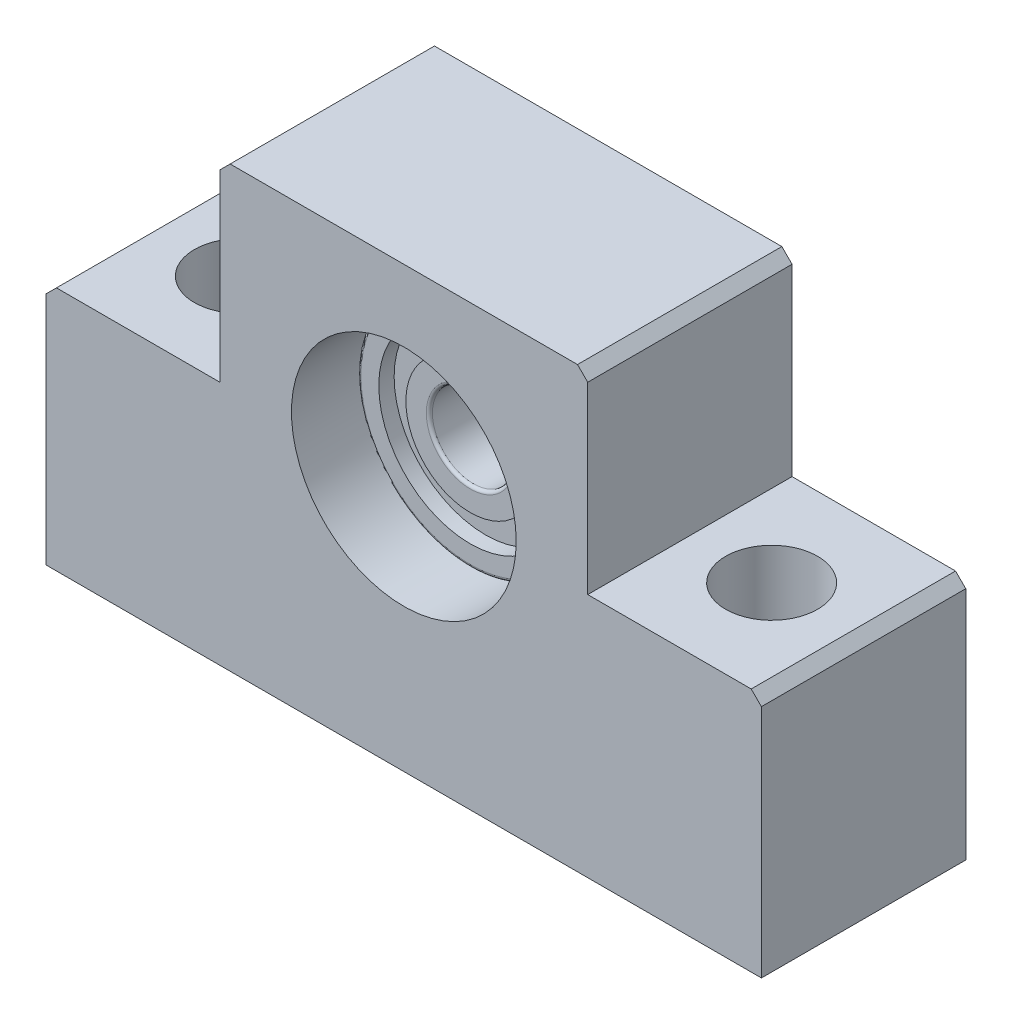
ISO-10303-21;
HEADER;
FILE_DESCRIPTION(('STEP AP214'),'2;1');
FILE_NAME('part.step','',(''),(''),'','','');
FILE_SCHEMA(('AUTOMOTIVE_DESIGN { 1 0 10303 214 1 1 1 1 }'));
ENDSEC;
DATA;
#1=APPLICATION_CONTEXT('core data for automotive mechanical design processes');
#2=APPLICATION_PROTOCOL_DEFINITION('international standard','automotive_design',2000,#1);
#3=PRODUCT_CONTEXT('',#1,'mechanical');
#4=PRODUCT('Part','Part','',(#3));
#5=PRODUCT_RELATED_PRODUCT_CATEGORY('part','',(#4));
#6=PRODUCT_DEFINITION_FORMATION('','',#4);
#7=PRODUCT_DEFINITION_CONTEXT('part definition',#1,'design');
#8=PRODUCT_DEFINITION('design','',#6,#7);
#9=PRODUCT_DEFINITION_SHAPE('','',#8);
#10=(LENGTH_UNIT() NAMED_UNIT(*) SI_UNIT(.MILLI.,.METRE.));
#11=(NAMED_UNIT(*) PLANE_ANGLE_UNIT() SI_UNIT($,.RADIAN.));
#12=(NAMED_UNIT(*) SI_UNIT($,.STERADIAN.) SOLID_ANGLE_UNIT());
#13=UNCERTAINTY_MEASURE_WITH_UNIT(LENGTH_MEASURE(1.E-05),#10,'distance_accuracy_value','');
#14=(GEOMETRIC_REPRESENTATION_CONTEXT(3) GLOBAL_UNCERTAINTY_ASSIGNED_CONTEXT((#13)) GLOBAL_UNIT_ASSIGNED_CONTEXT((#10,
#11,#12)) REPRESENTATION_CONTEXT('',''));
#15=CARTESIAN_POINT('',(0.,0.,0.));
#16=DIRECTION('',(0.,0.,1.));
#17=DIRECTION('',(1.,0.,0.));
#18=AXIS2_PLACEMENT_3D('',#15,#16,#17);
#19=CARTESIAN_POINT('',(0.,0.,3.2));
#20=DIRECTION('',(0.,0.,-1.));
#21=DIRECTION('',(-1.,0.,0.));
#22=AXIS2_PLACEMENT_3D('',#19,#20,#21);
#23=TOROIDAL_SURFACE('',#22,4.3,0.3);
#24=CARTESIAN_POINT('',(0.,0.,3.5));
#25=DIRECTION('',(0.,0.,1.));
#26=DIRECTION('',(-1.,0.,0.));
#27=AXIS2_PLACEMENT_3D('',#24,#25,#26);
#28=CIRCLE('',#27,4.3);
#29=CARTESIAN_POINT('',(-4.3,0.,3.5));
#30=VERTEX_POINT('',#29);
#31=EDGE_CURVE('E263',#30,#30,#28,.F.);
#32=ORIENTED_EDGE('',*,*,#31,.F.);
#33=EDGE_LOOP('',(#32));
#34=FACE_BOUND('',#33,.T.);
#35=CARTESIAN_POINT('',(0.,0.,3.2));
#36=DIRECTION('',(0.,0.,1.));
#37=DIRECTION('',(1.,0.,0.));
#38=AXIS2_PLACEMENT_3D('',#35,#36,#37);
#39=CIRCLE('',#38,4.);
#40=CARTESIAN_POINT('',(4.,0.,3.2));
#41=VERTEX_POINT('',#40);
#42=EDGE_CURVE('E267',#41,#41,#39,.F.);
#43=ORIENTED_EDGE('',*,*,#42,.T.);
#44=EDGE_LOOP('',(#43));
#45=FACE_BOUND('',#44,.T.);
#46=ADVANCED_FACE('F16',(#34,#45),#23,.T.);
#47=CARTESIAN_POINT('',(0.,0.,-50.));
#48=DIRECTION('',(0.,0.,1.));
#49=DIRECTION('',(1.,0.,0.));
#50=AXIS2_PLACEMENT_3D('',#47,#48,#49);
#51=CYLINDRICAL_SURFACE('',#50,4.);
#52=ORIENTED_EDGE('',*,*,#42,.F.);
#53=EDGE_LOOP('',(#52));
#54=FACE_BOUND('',#53,.T.);
#55=CARTESIAN_POINT('',(0.,0.,-3.2));
#56=DIRECTION('',(0.,0.,-1.));
#57=DIRECTION('',(-1.,0.,0.));
#58=AXIS2_PLACEMENT_3D('',#55,#56,#57);
#59=CIRCLE('',#58,4.);
#60=CARTESIAN_POINT('',(-4.,0.,-3.2));
#61=VERTEX_POINT('',#60);
#62=EDGE_CURVE('E329',#61,#61,#59,.F.);
#63=ORIENTED_EDGE('',*,*,#62,.F.);
#64=EDGE_LOOP('',(#63));
#65=FACE_BOUND('',#64,.T.);
#66=ADVANCED_FACE('F337',(#54,#65),#51,.F.);
#67=CARTESIAN_POINT('',(0.,6.3,3.5));
#68=DIRECTION('',(0.,0.,1.));
#69=DIRECTION('',(1.,0.,0.));
#70=AXIS2_PLACEMENT_3D('',#67,#68,#69);
#71=PLANE('',#70);
#72=CARTESIAN_POINT('',(0.,0.,3.5));
#73=DIRECTION('',(0.,0.,1.));
#74=DIRECTION('',(1.,0.,0.));
#75=AXIS2_PLACEMENT_3D('',#72,#73,#74);
#76=CIRCLE('',#75,6.3);
#77=CARTESIAN_POINT('',(6.3,0.,3.5));
#78=VERTEX_POINT('',#77);
#79=EDGE_CURVE('E21',#78,#78,#76,.F.);
#80=ORIENTED_EDGE('',*,*,#79,.F.);
#81=EDGE_LOOP('',(#80));
#82=FACE_BOUND('',#81,.T.);
#83=ORIENTED_EDGE('',*,*,#31,.T.);
#84=EDGE_LOOP('',(#83));
#85=FACE_BOUND('',#84,.T.);
#86=ADVANCED_FACE('F245',(#82,#85),#71,.T.);
#87=CARTESIAN_POINT('',(0.,0.,-3.2));
#88=DIRECTION('',(0.,0.,-1.));
#89=DIRECTION('',(-1.,0.,0.));
#90=AXIS2_PLACEMENT_3D('',#87,#88,#89);
#91=TOROIDAL_SURFACE('',#90,4.3,0.3);
#92=ORIENTED_EDGE('',*,*,#62,.T.);
#93=EDGE_LOOP('',(#92));
#94=FACE_BOUND('',#93,.T.);
#95=CARTESIAN_POINT('',(0.,0.,-3.5));
#96=DIRECTION('',(0.,0.,-1.));
#97=DIRECTION('',(-1.,0.,0.));
#98=AXIS2_PLACEMENT_3D('',#95,#96,#97);
#99=CIRCLE('',#98,4.30000000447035);
#100=CARTESIAN_POINT('',(-4.30000000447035,0.,-3.5));
#101=VERTEX_POINT('',#100);
#102=EDGE_CURVE('E218',#101,#101,#99,.F.);
#103=ORIENTED_EDGE('',*,*,#102,.F.);
#104=EDGE_LOOP('',(#103));
#105=FACE_BOUND('',#104,.T.);
#106=ADVANCED_FACE('F240',(#94,#105),#91,.T.);
#107=CARTESIAN_POINT('',(0.,0.,-50.));
#108=DIRECTION('',(0.,0.,1.));
#109=DIRECTION('',(1.,0.,0.));
#110=AXIS2_PLACEMENT_3D('',#107,#108,#109);
#111=CYLINDRICAL_SURFACE('',#110,6.3);
#112=CARTESIAN_POINT('',(0.,0.,2.));
#113=DIRECTION('',(0.,0.,1.));
#114=DIRECTION('',(1.,0.,0.));
#115=AXIS2_PLACEMENT_3D('',#112,#113,#114);
#116=CIRCLE('',#115,6.3);
#117=CARTESIAN_POINT('',(6.3,0.,2.));
#118=VERTEX_POINT('',#117);
#119=EDGE_CURVE('E324',#118,#118,#116,.F.);
#120=ORIENTED_EDGE('',*,*,#119,.F.);
#121=EDGE_LOOP('',(#120));
#122=FACE_BOUND('',#121,.T.);
#123=ORIENTED_EDGE('',*,*,#79,.T.);
#124=EDGE_LOOP('',(#123));
#125=FACE_BOUND('',#124,.T.);
#126=ADVANCED_FACE('F236',(#122,#125),#111,.T.);
#127=CARTESIAN_POINT('',(0.,4.3,-3.5));
#128=DIRECTION('',(0.,0.,-1.));
#129=DIRECTION('',(-1.,0.,0.));
#130=AXIS2_PLACEMENT_3D('',#127,#128,#129);
#131=PLANE('',#130);
#132=ORIENTED_EDGE('',*,*,#102,.T.);
#133=EDGE_LOOP('',(#132));
#134=FACE_BOUND('',#133,.T.);
#135=CARTESIAN_POINT('',(0.,0.,-3.5));
#136=DIRECTION('',(0.,0.,1.));
#137=DIRECTION('',(1.,0.,0.));
#138=AXIS2_PLACEMENT_3D('',#135,#136,#137);
#139=CIRCLE('',#138,6.3);
#140=CARTESIAN_POINT('',(6.3,0.,-3.5));
#141=VERTEX_POINT('',#140);
#142=EDGE_CURVE('E322',#141,#141,#139,.T.);
#143=ORIENTED_EDGE('',*,*,#142,.F.);
#144=EDGE_LOOP('',(#143));
#145=FACE_BOUND('',#144,.T.);
#146=ADVANCED_FACE('F225',(#134,#145),#131,.T.);
#147=CARTESIAN_POINT('',(0.,8.95,2.));
#148=DIRECTION('',(0.,0.,1.));
#149=DIRECTION('',(1.,0.,0.));
#150=AXIS2_PLACEMENT_3D('',#147,#148,#149);
#151=PLANE('',#150);
#152=CARTESIAN_POINT('',(0.,0.,2.));
#153=DIRECTION('',(0.,0.,1.));
#154=DIRECTION('',(1.,0.,0.));
#155=AXIS2_PLACEMENT_3D('',#152,#153,#154);
#156=CIRCLE('',#155,8.95);
#157=CARTESIAN_POINT('',(8.95,0.,2.));
#158=VERTEX_POINT('',#157);
#159=EDGE_CURVE('E319',#158,#158,#156,.T.);
#160=ORIENTED_EDGE('',*,*,#159,.T.);
#161=EDGE_LOOP('',(#160));
#162=FACE_BOUND('',#161,.T.);
#163=ORIENTED_EDGE('',*,*,#119,.T.);
#164=EDGE_LOOP('',(#163));
#165=FACE_BOUND('',#164,.T.);
#166=ADVANCED_FACE('F235',(#162,#165),#151,.T.);
#167=CARTESIAN_POINT('',(0.,0.,-50.));
#168=DIRECTION('',(0.,0.,1.));
#169=DIRECTION('',(1.,0.,0.));
#170=AXIS2_PLACEMENT_3D('',#167,#168,#169);
#171=CYLINDRICAL_SURFACE('',#170,6.3);
#172=ORIENTED_EDGE('',*,*,#142,.T.);
#173=EDGE_LOOP('',(#172));
#174=FACE_BOUND('',#173,.T.);
#175=CARTESIAN_POINT('',(0.,0.,-2.));
#176=DIRECTION('',(0.,0.,1.));
#177=DIRECTION('',(1.,0.,0.));
#178=AXIS2_PLACEMENT_3D('',#175,#176,#177);
#179=CIRCLE('',#178,6.3);
#180=CARTESIAN_POINT('',(6.3,0.,-2.));
#181=VERTEX_POINT('',#180);
#182=EDGE_CURVE('E316',#181,#181,#179,.T.);
#183=ORIENTED_EDGE('',*,*,#182,.F.);
#184=EDGE_LOOP('',(#183));
#185=FACE_BOUND('',#184,.T.);
#186=ADVANCED_FACE('F550',(#174,#185),#171,.T.);
#187=CARTESIAN_POINT('',(0.,0.,-50.));
#188=DIRECTION('',(0.,0.,1.));
#189=DIRECTION('',(1.,0.,0.));
#190=AXIS2_PLACEMENT_3D('',#187,#188,#189);
#191=CYLINDRICAL_SURFACE('',#190,8.95);
#192=CARTESIAN_POINT('',(0.,0.,3.5));
#193=DIRECTION('',(0.,0.,1.));
#194=DIRECTION('',(1.,0.,0.));
#195=AXIS2_PLACEMENT_3D('',#192,#193,#194);
#196=CIRCLE('',#195,8.95);
#197=CARTESIAN_POINT('',(8.95,0.,3.5));
#198=VERTEX_POINT('',#197);
#199=EDGE_CURVE('E313',#198,#198,#196,.F.);
#200=ORIENTED_EDGE('',*,*,#199,.F.);
#201=EDGE_LOOP('',(#200));
#202=FACE_BOUND('',#201,.T.);
#203=ORIENTED_EDGE('',*,*,#159,.F.);
#204=EDGE_LOOP('',(#203));
#205=FACE_BOUND('',#204,.T.);
#206=ADVANCED_FACE('F541',(#202,#205),#191,.F.);
#207=CARTESIAN_POINT('',(0.,6.3,-2.));
#208=DIRECTION('',(0.,0.,-1.));
#209=DIRECTION('',(-1.,0.,0.));
#210=AXIS2_PLACEMENT_3D('',#207,#208,#209);
#211=PLANE('',#210);
#212=ORIENTED_EDGE('',*,*,#182,.T.);
#213=EDGE_LOOP('',(#212));
#214=FACE_BOUND('',#213,.T.);
#215=CARTESIAN_POINT('',(0.,0.,-2.));
#216=DIRECTION('',(0.,0.,1.));
#217=DIRECTION('',(1.,0.,0.));
#218=AXIS2_PLACEMENT_3D('',#215,#216,#217);
#219=CIRCLE('',#218,8.95);
#220=CARTESIAN_POINT('',(8.95,0.,-2.));
#221=VERTEX_POINT('',#220);
#222=EDGE_CURVE('E310',#221,#221,#219,.F.);
#223=ORIENTED_EDGE('',*,*,#222,.T.);
#224=EDGE_LOOP('',(#223));
#225=FACE_BOUND('',#224,.T.);
#226=ADVANCED_FACE('F533',(#214,#225),#211,.T.);
#227=CARTESIAN_POINT('',(0.,10.7,3.5));
#228=DIRECTION('',(0.,0.,1.));
#229=DIRECTION('',(1.,0.,0.));
#230=AXIS2_PLACEMENT_3D('',#227,#228,#229);
#231=PLANE('',#230);
#232=CARTESIAN_POINT('',(0.,0.,3.5));
#233=DIRECTION('',(0.,0.,-1.));
#234=DIRECTION('',(-1.,0.,0.));
#235=AXIS2_PLACEMENT_3D('',#232,#233,#234);
#236=CIRCLE('',#235,10.7);
#237=CARTESIAN_POINT('',(-10.7,0.,3.5));
#238=VERTEX_POINT('',#237);
#239=EDGE_CURVE('E309',#238,#238,#236,.T.);
#240=ORIENTED_EDGE('',*,*,#239,.F.);
#241=EDGE_LOOP('',(#240));
#242=FACE_BOUND('',#241,.T.);
#243=ORIENTED_EDGE('',*,*,#199,.T.);
#244=EDGE_LOOP('',(#243));
#245=FACE_BOUND('',#244,.T.);
#246=ADVANCED_FACE('F525',(#242,#245),#231,.T.);
#247=CARTESIAN_POINT('',(0.,0.,-50.));
#248=DIRECTION('',(0.,0.,1.));
#249=DIRECTION('',(1.,0.,0.));
#250=AXIS2_PLACEMENT_3D('',#247,#248,#249);
#251=CYLINDRICAL_SURFACE('',#250,8.95);
#252=ORIENTED_EDGE('',*,*,#222,.F.);
#253=EDGE_LOOP('',(#252));
#254=FACE_BOUND('',#253,.T.);
#255=CARTESIAN_POINT('',(0.,0.,-3.5));
#256=DIRECTION('',(0.,0.,1.));
#257=DIRECTION('',(1.,0.,0.));
#258=AXIS2_PLACEMENT_3D('',#255,#256,#257);
#259=CIRCLE('',#258,8.95);
#260=CARTESIAN_POINT('',(8.95,0.,-3.5));
#261=VERTEX_POINT('',#260);
#262=EDGE_CURVE('E306',#261,#261,#259,.T.);
#263=ORIENTED_EDGE('',*,*,#262,.F.);
#264=EDGE_LOOP('',(#263));
#265=FACE_BOUND('',#264,.T.);
#266=ADVANCED_FACE('F199',(#254,#265),#251,.F.);
#267=CARTESIAN_POINT('',(0.,0.,3.2));
#268=DIRECTION('',(0.,0.,-1.));
#269=DIRECTION('',(-1.,0.,0.));
#270=AXIS2_PLACEMENT_3D('',#267,#268,#269);
#271=TOROIDAL_SURFACE('',#270,10.7,0.299999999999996);
#272=CARTESIAN_POINT('',(0.,0.,3.2));
#273=DIRECTION('',(0.,0.,1.));
#274=DIRECTION('',(1.,0.,0.));
#275=AXIS2_PLACEMENT_3D('',#272,#273,#274);
#276=CIRCLE('',#275,11.);
#277=CARTESIAN_POINT('',(11.,0.,3.2));
#278=VERTEX_POINT('',#277);
#279=EDGE_CURVE('E164',#278,#278,#276,.T.);
#280=ORIENTED_EDGE('',*,*,#279,.T.);
#281=EDGE_LOOP('',(#280));
#282=FACE_BOUND('',#281,.T.);
#283=ORIENTED_EDGE('',*,*,#239,.T.);
#284=EDGE_LOOP('',(#283));
#285=FACE_BOUND('',#284,.T.);
#286=ADVANCED_FACE('F194',(#282,#285),#271,.T.);
#287=CARTESIAN_POINT('',(0.,8.95,-3.5));
#288=DIRECTION('',(0.,0.,-1.));
#289=DIRECTION('',(-1.,0.,0.));
#290=AXIS2_PLACEMENT_3D('',#287,#288,#289);
#291=PLANE('',#290);
#292=ORIENTED_EDGE('',*,*,#262,.T.);
#293=EDGE_LOOP('',(#292));
#294=FACE_BOUND('',#293,.T.);
#295=CARTESIAN_POINT('',(0.,0.,-3.5));
#296=DIRECTION('',(0.,0.,1.));
#297=DIRECTION('',(-1.,0.,0.));
#298=AXIS2_PLACEMENT_3D('',#295,#296,#297);
#299=CIRCLE('',#298,10.7);
#300=CARTESIAN_POINT('',(-10.7,0.,-3.5));
#301=VERTEX_POINT('',#300);
#302=EDGE_CURVE('E161',#301,#301,#299,.T.);
#303=ORIENTED_EDGE('',*,*,#302,.F.);
#304=EDGE_LOOP('',(#303));
#305=FACE_BOUND('',#304,.T.);
#306=ADVANCED_FACE('F198',(#294,#305),#291,.T.);
#307=CARTESIAN_POINT('',(0.,0.,10.));
#308=DIRECTION('',(0.,0.,1.));
#309=DIRECTION('',(1.,0.,0.));
#310=AXIS2_PLACEMENT_3D('',#307,#308,#309);
#311=CYLINDRICAL_SURFACE('',#310,11.);
#312=CARTESIAN_POINT('',(0.,0.,10.));
#313=DIRECTION('',(0.,0.,1.));
#314=DIRECTION('',(1.,0.,0.));
#315=AXIS2_PLACEMENT_3D('',#312,#313,#314);
#316=CIRCLE('',#315,11.);
#317=CARTESIAN_POINT('',(11.,0.,10.));
#318=VERTEX_POINT('',#317);
#319=EDGE_CURVE('E153',#318,#318,#316,.F.);
#320=ORIENTED_EDGE('',*,*,#319,.F.);
#321=EDGE_LOOP('',(#320));
#322=FACE_BOUND('',#321,.T.);
#323=ORIENTED_EDGE('',*,*,#279,.F.);
#324=EDGE_LOOP('',(#323));
#325=FACE_BOUND('',#324,.T.);
#326=ADVANCED_FACE('F173',(#322,#325),#311,.F.);
#327=CARTESIAN_POINT('',(0.,0.,-3.2));
#328=DIRECTION('',(0.,0.,-1.));
#329=DIRECTION('',(-1.,0.,0.));
#330=AXIS2_PLACEMENT_3D('',#327,#328,#329);
#331=TOROIDAL_SURFACE('',#330,10.7,0.3);
#332=ORIENTED_EDGE('',*,*,#302,.T.);
#333=EDGE_LOOP('',(#332));
#334=FACE_BOUND('',#333,.T.);
#335=CARTESIAN_POINT('',(0.,0.,-3.2));
#336=DIRECTION('',(0.,0.,1.));
#337=DIRECTION('',(1.,0.,0.));
#338=AXIS2_PLACEMENT_3D('',#335,#336,#337);
#339=CIRCLE('',#338,11.);
#340=CARTESIAN_POINT('',(11.,0.,-3.2));
#341=VERTEX_POINT('',#340);
#342=EDGE_CURVE('E141',#341,#341,#339,.F.);
#343=ORIENTED_EDGE('',*,*,#342,.T.);
#344=EDGE_LOOP('',(#343));
#345=FACE_BOUND('',#344,.T.);
#346=ADVANCED_FACE('F167',(#334,#345),#331,.T.);
#347=CARTESIAN_POINT('',(35.,-2.,10.));
#348=DIRECTION('',(-0.707106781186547,-0.707106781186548,0.));
#349=DIRECTION('',(0.707106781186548,-0.707106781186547,0.));
#350=AXIS2_PLACEMENT_3D('',#347,#348,#349);
#351=PLANE('',#350);
#352=DIRECTION('',(0.,0.,-1.));
#353=VECTOR('',#352,1.);
#354=CARTESIAN_POINT('',(34.,-1.,10.));
#355=LINE('',#354,#353);
#356=CARTESIAN_POINT('',(34.,-1.,-10.));
#357=VERTEX_POINT('',#356);
#358=CARTESIAN_POINT('',(34.,-1.,10.));
#359=VERTEX_POINT('',#358);
#360=EDGE_CURVE('E434',#357,#359,#355,.F.);
#361=ORIENTED_EDGE('',*,*,#360,.T.);
#362=DIRECTION('',(-0.707106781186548,0.707106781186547,0.));
#363=VECTOR('',#362,1.);
#364=CARTESIAN_POINT('',(35.,-2.,10.));
#365=LINE('',#364,#363);
#366=CARTESIAN_POINT('',(35.,-2.,10.));
#367=VERTEX_POINT('',#366);
#368=EDGE_CURVE('E104',#367,#359,#365,.T.);
#369=ORIENTED_EDGE('',*,*,#368,.F.);
#370=DIRECTION('',(0.,0.,1.));
#371=VECTOR('',#370,1.);
#372=CARTESIAN_POINT('',(35.,-2.,10.));
#373=LINE('',#372,#371);
#374=CARTESIAN_POINT('',(35.,-2.,-10.));
#375=VERTEX_POINT('',#374);
#376=EDGE_CURVE('E130',#367,#375,#373,.F.);
#377=ORIENTED_EDGE('',*,*,#376,.T.);
#378=DIRECTION('',(0.707106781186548,-0.707106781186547,0.));
#379=VECTOR('',#378,1.);
#380=CARTESIAN_POINT('',(35.,-2.,-10.));
#381=LINE('',#380,#379);
#382=EDGE_CURVE('E159',#357,#375,#381,.T.);
#383=ORIENTED_EDGE('',*,*,#382,.F.);
#384=EDGE_LOOP('',(#361,#369,#377,#383));
#385=FACE_BOUND('',#384,.T.);
#386=ADVANCED_FACE('F172',(#385),#351,.F.);
#387=CARTESIAN_POINT('',(26.,-25.,0.));
#388=DIRECTION('',(0.,1.,0.));
#389=DIRECTION('',(0.,0.,1.));
#390=AXIS2_PLACEMENT_3D('',#387,#388,#389);
#391=CYLINDRICAL_SURFACE('',#390,4.5);
#392=CARTESIAN_POINT('',(26.,-1.,0.));
#393=DIRECTION('',(0.,1.,0.));
#394=DIRECTION('',(0.,0.,1.));
#395=AXIS2_PLACEMENT_3D('',#392,#393,#394);
#396=CIRCLE('',#395,4.5);
#397=CARTESIAN_POINT('',(26.,-1.,4.5));
#398=VERTEX_POINT('',#397);
#399=EDGE_CURVE('E297',#398,#398,#396,.T.);
#400=ORIENTED_EDGE('',*,*,#399,.T.);
#401=EDGE_LOOP('',(#400));
#402=FACE_BOUND('',#401,.T.);
#403=CARTESIAN_POINT('',(26.,-25.,0.));
#404=DIRECTION('',(0.,1.,0.));
#405=DIRECTION('',(0.,0.,1.));
#406=AXIS2_PLACEMENT_3D('',#403,#404,#405);
#407=CIRCLE('',#406,4.5);
#408=CARTESIAN_POINT('',(26.,-25.,4.5));
#409=VERTEX_POINT('',#408);
#410=EDGE_CURVE('E123',#409,#409,#407,.F.);
#411=ORIENTED_EDGE('',*,*,#410,.T.);
#412=EDGE_LOOP('',(#411));
#413=FACE_BOUND('',#412,.T.);
#414=ADVANCED_FACE('F405',(#402,#413),#391,.F.);
#415=CARTESIAN_POINT('',(18.,17.,10.));
#416=DIRECTION('',(-0.707106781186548,-0.707106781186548,0.));
#417=DIRECTION('',(0.707106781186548,-0.707106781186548,0.));
#418=AXIS2_PLACEMENT_3D('',#415,#416,#417);
#419=PLANE('',#418);
#420=DIRECTION('',(0.,0.,-1.));
#421=VECTOR('',#420,1.);
#422=CARTESIAN_POINT('',(17.,18.,10.));
#423=LINE('',#422,#421);
#424=CARTESIAN_POINT('',(17.,18.,-10.));
#425=VERTEX_POINT('',#424);
#426=CARTESIAN_POINT('',(17.,18.,10.));
#427=VERTEX_POINT('',#426);
#428=EDGE_CURVE('E462',#425,#427,#423,.F.);
#429=ORIENTED_EDGE('',*,*,#428,.T.);
#430=DIRECTION('',(-0.707106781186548,0.707106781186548,0.));
#431=VECTOR('',#430,1.);
#432=CARTESIAN_POINT('',(18.,17.,10.));
#433=LINE('',#432,#431);
#434=CARTESIAN_POINT('',(18.,17.,10.));
#435=VERTEX_POINT('',#434);
#436=EDGE_CURVE('E150',#435,#427,#433,.T.);
#437=ORIENTED_EDGE('',*,*,#436,.F.);
#438=DIRECTION('',(0.,0.,1.));
#439=VECTOR('',#438,1.);
#440=CARTESIAN_POINT('',(18.,17.,10.));
#441=LINE('',#440,#439);
#442=CARTESIAN_POINT('',(18.,17.,-10.));
#443=VERTEX_POINT('',#442);
#444=EDGE_CURVE('E429',#435,#443,#441,.F.);
#445=ORIENTED_EDGE('',*,*,#444,.T.);
#446=DIRECTION('',(0.707106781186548,-0.707106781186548,0.));
#447=VECTOR('',#446,1.);
#448=CARTESIAN_POINT('',(18.,17.,-10.));
#449=LINE('',#448,#447);
#450=EDGE_CURVE('E157',#425,#443,#449,.T.);
#451=ORIENTED_EDGE('',*,*,#450,.F.);
#452=EDGE_LOOP('',(#429,#437,#445,#451));
#453=FACE_BOUND('',#452,.T.);
#454=ADVANCED_FACE('F402',(#453),#419,.F.);
#455=CARTESIAN_POINT('',(-17.,18.,10.));
#456=DIRECTION('',(0.707106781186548,-0.707106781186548,0.));
#457=DIRECTION('',(0.707106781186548,0.707106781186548,0.));
#458=AXIS2_PLACEMENT_3D('',#455,#456,#457);
#459=PLANE('',#458);
#460=DIRECTION('',(0.,0.,-1.));
#461=VECTOR('',#460,1.);
#462=CARTESIAN_POINT('',(-18.,17.,10.));
#463=LINE('',#462,#461);
#464=CARTESIAN_POINT('',(-18.,17.,-10.));
#465=VERTEX_POINT('',#464);
#466=CARTESIAN_POINT('',(-18.,17.,10.));
#467=VERTEX_POINT('',#466);
#468=EDGE_CURVE('E453',#465,#467,#463,.F.);
#469=ORIENTED_EDGE('',*,*,#468,.T.);
#470=DIRECTION('',(-0.707106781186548,-0.707106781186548,0.));
#471=VECTOR('',#470,1.);
#472=CARTESIAN_POINT('',(-17.,18.,10.));
#473=LINE('',#472,#471);
#474=CARTESIAN_POINT('',(-17.,18.,10.));
#475=VERTEX_POINT('',#474);
#476=EDGE_CURVE('E148',#475,#467,#473,.T.);
#477=ORIENTED_EDGE('',*,*,#476,.F.);
#478=DIRECTION('',(0.,0.,-1.));
#479=VECTOR('',#478,1.);
#480=CARTESIAN_POINT('',(-17.,18.,10.));
#481=LINE('',#480,#479);
#482=CARTESIAN_POINT('',(-17.,18.,-10.));
#483=VERTEX_POINT('',#482);
#484=EDGE_CURVE('E456',#475,#483,#481,.T.);
#485=ORIENTED_EDGE('',*,*,#484,.T.);
#486=DIRECTION('',(0.707106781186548,0.707106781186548,0.));
#487=VECTOR('',#486,1.);
#488=CARTESIAN_POINT('',(-17.,18.,-10.));
#489=LINE('',#488,#487);
#490=EDGE_CURVE('E155',#465,#483,#489,.T.);
#491=ORIENTED_EDGE('',*,*,#490,.F.);
#492=EDGE_LOOP('',(#469,#477,#485,#491));
#493=FACE_BOUND('',#492,.T.);
#494=ADVANCED_FACE('F398',(#493),#459,.F.);
#495=CARTESIAN_POINT('',(-26.,-1.,0.));
#496=DIRECTION('',(0.,-1.,0.));
#497=DIRECTION('',(0.,0.,-1.));
#498=AXIS2_PLACEMENT_3D('',#495,#496,#497);
#499=CYLINDRICAL_SURFACE('',#498,4.5);
#500=CARTESIAN_POINT('',(-26.,-25.,0.));
#501=DIRECTION('',(0.,-1.,0.));
#502=DIRECTION('',(0.,0.,-1.));
#503=AXIS2_PLACEMENT_3D('',#500,#501,#502);
#504=CIRCLE('',#503,4.5);
#505=CARTESIAN_POINT('',(-26.,-25.,-4.5));
#506=VERTEX_POINT('',#505);
#507=EDGE_CURVE('E122',#506,#506,#504,.T.);
#508=ORIENTED_EDGE('',*,*,#507,.T.);
#509=EDGE_LOOP('',(#508));
#510=FACE_BOUND('',#509,.T.);
#511=CARTESIAN_POINT('',(-26.,-1.,0.));
#512=DIRECTION('',(0.,-1.,0.));
#513=DIRECTION('',(0.,0.,-1.));
#514=AXIS2_PLACEMENT_3D('',#511,#512,#513);
#515=CIRCLE('',#514,4.5);
#516=CARTESIAN_POINT('',(-26.,-1.,-4.5));
#517=VERTEX_POINT('',#516);
#518=EDGE_CURVE('E292',#517,#517,#515,.F.);
#519=ORIENTED_EDGE('',*,*,#518,.T.);
#520=EDGE_LOOP('',(#519));
#521=FACE_BOUND('',#520,.T.);
#522=ADVANCED_FACE('F395',(#510,#521),#499,.F.);
#523=CARTESIAN_POINT('',(-34.,-1.,10.));
#524=DIRECTION('',(0.707106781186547,-0.707106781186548,0.));
#525=DIRECTION('',(0.707106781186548,0.707106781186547,0.));
#526=AXIS2_PLACEMENT_3D('',#523,#524,#525);
#527=PLANE('',#526);
#528=DIRECTION('',(0.,0.,-1.));
#529=VECTOR('',#528,1.);
#530=CARTESIAN_POINT('',(-35.,-2.,10.));
#531=LINE('',#530,#529);
#532=CARTESIAN_POINT('',(-35.,-2.,-10.));
#533=VERTEX_POINT('',#532);
#534=CARTESIAN_POINT('',(-35.,-2.,10.));
#535=VERTEX_POINT('',#534);
#536=EDGE_CURVE('E295',#533,#535,#531,.F.);
#537=ORIENTED_EDGE('',*,*,#536,.T.);
#538=DIRECTION('',(-0.707106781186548,-0.707106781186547,0.));
#539=VECTOR('',#538,1.);
#540=CARTESIAN_POINT('',(-34.,-1.,10.));
#541=LINE('',#540,#539);
#542=CARTESIAN_POINT('',(-34.,-1.,10.));
#543=VERTEX_POINT('',#542);
#544=EDGE_CURVE('E144',#543,#535,#541,.T.);
#545=ORIENTED_EDGE('',*,*,#544,.F.);
#546=DIRECTION('',(0.,0.,-1.));
#547=VECTOR('',#546,1.);
#548=CARTESIAN_POINT('',(-34.,-1.,10.));
#549=LINE('',#548,#547);
#550=CARTESIAN_POINT('',(-34.,-1.,-10.));
#551=VERTEX_POINT('',#550);
#552=EDGE_CURVE('E296',#543,#551,#549,.T.);
#553=ORIENTED_EDGE('',*,*,#552,.T.);
#554=DIRECTION('',(0.707106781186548,0.707106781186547,0.));
#555=VECTOR('',#554,1.);
#556=CARTESIAN_POINT('',(-34.,-1.,-10.));
#557=LINE('',#556,#555);
#558=EDGE_CURVE('E36',#533,#551,#557,.T.);
#559=ORIENTED_EDGE('',*,*,#558,.F.);
#560=EDGE_LOOP('',(#537,#545,#553,#559));
#561=FACE_BOUND('',#560,.T.);
#562=ADVANCED_FACE('F392',(#561),#527,.F.);
#563=CARTESIAN_POINT('',(0.,0.,10.));
#564=DIRECTION('',(0.,0.,1.));
#565=DIRECTION('',(1.,0.,0.));
#566=AXIS2_PLACEMENT_3D('',#563,#564,#565);
#567=PLANE('',#566);
#568=DIRECTION('',(1.,0.,0.));
#569=VECTOR('',#568,1.);
#570=CARTESIAN_POINT('',(-18.,-1.,10.));
#571=LINE('',#570,#569);
#572=CARTESIAN_POINT('',(-18.,-1.,10.));
#573=VERTEX_POINT('',#572);
#574=EDGE_CURVE('E446',#573,#543,#571,.F.);
#575=ORIENTED_EDGE('',*,*,#574,.T.);
#576=ORIENTED_EDGE('',*,*,#544,.T.);
#577=DIRECTION('',(0.,1.,0.));
#578=VECTOR('',#577,1.);
#579=CARTESIAN_POINT('',(-35.,-2.,10.));
#580=LINE('',#579,#578);
#581=CARTESIAN_POINT('',(-35.,-25.,10.));
#582=VERTEX_POINT('',#581);
#583=EDGE_CURVE('E117',#535,#582,#580,.F.);
#584=ORIENTED_EDGE('',*,*,#583,.T.);
#585=DIRECTION('',(1.,0.,0.));
#586=VECTOR('',#585,1.);
#587=CARTESIAN_POINT('',(-35.,-25.,10.));
#588=LINE('',#587,#586);
#589=CARTESIAN_POINT('',(35.,-25.,10.));
#590=VERTEX_POINT('',#589);
#591=EDGE_CURVE('E110',#582,#590,#588,.T.);
#592=ORIENTED_EDGE('',*,*,#591,.T.);
#593=DIRECTION('',(0.,1.,0.));
#594=VECTOR('',#593,1.);
#595=CARTESIAN_POINT('',(35.,-25.,10.));
#596=LINE('',#595,#594);
#597=EDGE_CURVE('E115',#590,#367,#596,.T.);
#598=ORIENTED_EDGE('',*,*,#597,.T.);
#599=ORIENTED_EDGE('',*,*,#368,.T.);
#600=DIRECTION('',(1.,0.,0.));
#601=VECTOR('',#600,1.);
#602=CARTESIAN_POINT('',(34.,-1.,10.));
#603=LINE('',#602,#601);
#604=CARTESIAN_POINT('',(18.,-1.,10.));
#605=VERTEX_POINT('',#604);
#606=EDGE_CURVE('E300',#359,#605,#603,.F.);
#607=ORIENTED_EDGE('',*,*,#606,.T.);
#608=DIRECTION('',(0.,1.,0.));
#609=VECTOR('',#608,1.);
#610=CARTESIAN_POINT('',(18.,-1.,10.));
#611=LINE('',#610,#609);
#612=EDGE_CURVE('E426',#605,#435,#611,.T.);
#613=ORIENTED_EDGE('',*,*,#612,.T.);
#614=ORIENTED_EDGE('',*,*,#436,.T.);
#615=DIRECTION('',(1.,0.,0.));
#616=VECTOR('',#615,1.);
#617=CARTESIAN_POINT('',(17.,18.,10.));
#618=LINE('',#617,#616);
#619=EDGE_CURVE('E459',#427,#475,#618,.F.);
#620=ORIENTED_EDGE('',*,*,#619,.T.);
#621=ORIENTED_EDGE('',*,*,#476,.T.);
#622=DIRECTION('',(0.,1.,0.));
#623=VECTOR('',#622,1.);
#624=CARTESIAN_POINT('',(-18.,17.,10.));
#625=LINE('',#624,#623);
#626=EDGE_CURVE('E451',#467,#573,#625,.F.);
#627=ORIENTED_EDGE('',*,*,#626,.T.);
#628=EDGE_LOOP('',(#575,#576,#584,#592,#598,#599,#607,#613,#614,#620,#621,#627));
#629=FACE_BOUND('',#628,.T.);
#630=ORIENTED_EDGE('',*,*,#319,.T.);
#631=EDGE_LOOP('',(#630));
#632=FACE_BOUND('',#631,.T.);
#633=ADVANCED_FACE('F113',(#629,#632),#567,.T.);
#634=CARTESIAN_POINT('',(0.,0.,10.));
#635=DIRECTION('',(0.,0.,1.));
#636=DIRECTION('',(1.,0.,0.));
#637=AXIS2_PLACEMENT_3D('',#634,#635,#636);
#638=CYLINDRICAL_SURFACE('',#637,11.);
#639=ORIENTED_EDGE('',*,*,#342,.F.);
#640=EDGE_LOOP('',(#639));
#641=FACE_BOUND('',#640,.T.);
#642=CARTESIAN_POINT('',(0.,0.,-10.));
#643=DIRECTION('',(0.,0.,1.));
#644=DIRECTION('',(1.,0.,0.));
#645=AXIS2_PLACEMENT_3D('',#642,#643,#644);
#646=CIRCLE('',#645,11.);
#647=CARTESIAN_POINT('',(11.,0.,-10.));
#648=VERTEX_POINT('',#647);
#649=EDGE_CURVE('E283',#648,#648,#646,.F.);
#650=ORIENTED_EDGE('',*,*,#649,.T.);
#651=EDGE_LOOP('',(#650));
#652=FACE_BOUND('',#651,.T.);
#653=ADVANCED_FACE('F385',(#641,#652),#638,.F.);
#654=CARTESIAN_POINT('',(-35.,-25.,10.));
#655=DIRECTION('',(0.,1.,0.));
#656=DIRECTION('',(0.,0.,1.));
#657=AXIS2_PLACEMENT_3D('',#654,#655,#656);
#658=PLANE('',#657);
#659=ORIENTED_EDGE('',*,*,#507,.F.);
#660=EDGE_LOOP('',(#659));
#661=FACE_BOUND('',#660,.T.);
#662=DIRECTION('',(0.,0.,1.));
#663=VECTOR('',#662,1.);
#664=CARTESIAN_POINT('',(35.,-25.,10.));
#665=LINE('',#664,#663);
#666=CARTESIAN_POINT('',(35.,-25.,-10.));
#667=VERTEX_POINT('',#666);
#668=EDGE_CURVE('E128',#667,#590,#665,.T.);
#669=ORIENTED_EDGE('',*,*,#668,.T.);
#670=ORIENTED_EDGE('',*,*,#591,.F.);
#671=DIRECTION('',(0.,0.,-1.));
#672=VECTOR('',#671,1.);
#673=CARTESIAN_POINT('',(-35.,-25.,10.));
#674=LINE('',#673,#672);
#675=CARTESIAN_POINT('',(-35.,-25.,-10.));
#676=VERTEX_POINT('',#675);
#677=EDGE_CURVE('E291',#582,#676,#674,.T.);
#678=ORIENTED_EDGE('',*,*,#677,.T.);
#679=DIRECTION('',(1.,0.,0.));
#680=VECTOR('',#679,1.);
#681=CARTESIAN_POINT('',(0.,-25.,-10.));
#682=LINE('',#681,#680);
#683=EDGE_CURVE('E135',#676,#667,#682,.T.);
#684=ORIENTED_EDGE('',*,*,#683,.T.);
#685=EDGE_LOOP('',(#669,#670,#678,#684));
#686=FACE_BOUND('',#685,.T.);
#687=ORIENTED_EDGE('',*,*,#410,.F.);
#688=EDGE_LOOP('',(#687));
#689=FACE_BOUND('',#688,.T.);
#690=ADVANCED_FACE('F133',(#661,#686,#689),#658,.F.);
#691=CARTESIAN_POINT('',(35.,-25.,10.));
#692=DIRECTION('',(-1.,0.,0.));
#693=DIRECTION('',(0.,0.,1.));
#694=AXIS2_PLACEMENT_3D('',#691,#692,#693);
#695=PLANE('',#694);
#696=ORIENTED_EDGE('',*,*,#376,.F.);
#697=ORIENTED_EDGE('',*,*,#597,.F.);
#698=ORIENTED_EDGE('',*,*,#668,.F.);
#699=DIRECTION('',(0.,1.,0.));
#700=VECTOR('',#699,1.);
#701=CARTESIAN_POINT('',(35.,0.,-10.));
#702=LINE('',#701,#700);
#703=EDGE_CURVE('E435',#667,#375,#702,.T.);
#704=ORIENTED_EDGE('',*,*,#703,.T.);
#705=EDGE_LOOP('',(#696,#697,#698,#704));
#706=FACE_BOUND('',#705,.T.);
#707=ADVANCED_FACE('F126',(#706),#695,.F.);
#708=CARTESIAN_POINT('',(34.,-1.,10.));
#709=DIRECTION('',(0.,-1.,0.));
#710=DIRECTION('',(0.,0.,-1.));
#711=AXIS2_PLACEMENT_3D('',#708,#709,#710);
#712=PLANE('',#711);
#713=ORIENTED_EDGE('',*,*,#399,.F.);
#714=EDGE_LOOP('',(#713));
#715=FACE_BOUND('',#714,.T.);
#716=DIRECTION('',(0.,0.,1.));
#717=VECTOR('',#716,1.);
#718=CARTESIAN_POINT('',(18.,-1.,10.));
#719=LINE('',#718,#717);
#720=CARTESIAN_POINT('',(18.,-1.,-10.));
#721=VERTEX_POINT('',#720);
#722=EDGE_CURVE('E299',#721,#605,#719,.T.);
#723=ORIENTED_EDGE('',*,*,#722,.T.);
#724=ORIENTED_EDGE('',*,*,#606,.F.);
#725=ORIENTED_EDGE('',*,*,#360,.F.);
#726=DIRECTION('',(1.,0.,0.));
#727=VECTOR('',#726,1.);
#728=CARTESIAN_POINT('',(0.,-1.,-10.));
#729=LINE('',#728,#727);
#730=EDGE_CURVE('E422',#357,#721,#729,.F.);
#731=ORIENTED_EDGE('',*,*,#730,.T.);
#732=EDGE_LOOP('',(#723,#724,#725,#731));
#733=FACE_BOUND('',#732,.T.);
#734=ADVANCED_FACE('F376',(#715,#733),#712,.F.);
#735=CARTESIAN_POINT('',(18.,-1.,10.));
#736=DIRECTION('',(-1.,0.,0.));
#737=DIRECTION('',(0.,0.,1.));
#738=AXIS2_PLACEMENT_3D('',#735,#736,#737);
#739=PLANE('',#738);
#740=ORIENTED_EDGE('',*,*,#444,.F.);
#741=ORIENTED_EDGE('',*,*,#612,.F.);
#742=ORIENTED_EDGE('',*,*,#722,.F.);
#743=DIRECTION('',(0.,1.,0.));
#744=VECTOR('',#743,1.);
#745=CARTESIAN_POINT('',(18.,0.,-10.));
#746=LINE('',#745,#744);
#747=EDGE_CURVE('E437',#721,#443,#746,.T.);
#748=ORIENTED_EDGE('',*,*,#747,.T.);
#749=EDGE_LOOP('',(#740,#741,#742,#748));
#750=FACE_BOUND('',#749,.T.);
#751=ADVANCED_FACE('F372',(#750),#739,.F.);
#752=CARTESIAN_POINT('',(17.,18.,10.));
#753=DIRECTION('',(0.,-1.,0.));
#754=DIRECTION('',(0.,0.,-1.));
#755=AXIS2_PLACEMENT_3D('',#752,#753,#754);
#756=PLANE('',#755);
#757=ORIENTED_EDGE('',*,*,#484,.F.);
#758=ORIENTED_EDGE('',*,*,#619,.F.);
#759=ORIENTED_EDGE('',*,*,#428,.F.);
#760=DIRECTION('',(1.,0.,0.));
#761=VECTOR('',#760,1.);
#762=CARTESIAN_POINT('',(0.,18.,-10.));
#763=LINE('',#762,#761);
#764=EDGE_CURVE('E467',#425,#483,#763,.F.);
#765=ORIENTED_EDGE('',*,*,#764,.T.);
#766=EDGE_LOOP('',(#757,#758,#759,#765));
#767=FACE_BOUND('',#766,.T.);
#768=ADVANCED_FACE('F368',(#767),#756,.F.);
#769=CARTESIAN_POINT('',(-18.,17.,10.));
#770=DIRECTION('',(1.,0.,0.));
#771=DIRECTION('',(0.,0.,-1.));
#772=AXIS2_PLACEMENT_3D('',#769,#770,#771);
#773=PLANE('',#772);
#774=DIRECTION('',(0.,0.,-1.));
#775=VECTOR('',#774,1.);
#776=CARTESIAN_POINT('',(-18.,-1.,10.));
#777=LINE('',#776,#775);
#778=CARTESIAN_POINT('',(-18.,-1.,-10.));
#779=VERTEX_POINT('',#778);
#780=EDGE_CURVE('E448',#779,#573,#777,.F.);
#781=ORIENTED_EDGE('',*,*,#780,.T.);
#782=ORIENTED_EDGE('',*,*,#626,.F.);
#783=ORIENTED_EDGE('',*,*,#468,.F.);
#784=DIRECTION('',(0.,1.,0.));
#785=VECTOR('',#784,1.);
#786=CARTESIAN_POINT('',(-18.,0.,-10.));
#787=LINE('',#786,#785);
#788=EDGE_CURVE('E469',#465,#779,#787,.F.);
#789=ORIENTED_EDGE('',*,*,#788,.T.);
#790=EDGE_LOOP('',(#781,#782,#783,#789));
#791=FACE_BOUND('',#790,.T.);
#792=ADVANCED_FACE('F364',(#791),#773,.F.);
#793=CARTESIAN_POINT('',(-18.,-1.,10.));
#794=DIRECTION('',(0.,-1.,0.));
#795=DIRECTION('',(0.,0.,-1.));
#796=AXIS2_PLACEMENT_3D('',#793,#794,#795);
#797=PLANE('',#796);
#798=ORIENTED_EDGE('',*,*,#518,.F.);
#799=EDGE_LOOP('',(#798));
#800=FACE_BOUND('',#799,.T.);
#801=ORIENTED_EDGE('',*,*,#552,.F.);
#802=ORIENTED_EDGE('',*,*,#574,.F.);
#803=ORIENTED_EDGE('',*,*,#780,.F.);
#804=DIRECTION('',(1.,0.,0.));
#805=VECTOR('',#804,1.);
#806=CARTESIAN_POINT('',(0.,-1.,-10.));
#807=LINE('',#806,#805);
#808=EDGE_CURVE('E27',#779,#551,#807,.F.);
#809=ORIENTED_EDGE('',*,*,#808,.T.);
#810=EDGE_LOOP('',(#801,#802,#803,#809));
#811=FACE_BOUND('',#810,.T.);
#812=ADVANCED_FACE('F357',(#800,#811),#797,.F.);
#813=CARTESIAN_POINT('',(-35.,-2.,10.));
#814=DIRECTION('',(1.,0.,0.));
#815=DIRECTION('',(0.,0.,-1.));
#816=AXIS2_PLACEMENT_3D('',#813,#814,#815);
#817=PLANE('',#816);
#818=ORIENTED_EDGE('',*,*,#677,.F.);
#819=ORIENTED_EDGE('',*,*,#583,.F.);
#820=ORIENTED_EDGE('',*,*,#536,.F.);
#821=DIRECTION('',(0.,1.,0.));
#822=VECTOR('',#821,1.);
#823=CARTESIAN_POINT('',(-35.,0.,-10.));
#824=LINE('',#823,#822);
#825=EDGE_CURVE('E11',#533,#676,#824,.F.);
#826=ORIENTED_EDGE('',*,*,#825,.T.);
#827=EDGE_LOOP('',(#818,#819,#820,#826));
#828=FACE_BOUND('',#827,.T.);
#829=ADVANCED_FACE('F350',(#828),#817,.F.);
#830=CARTESIAN_POINT('',(0.,0.,-10.));
#831=DIRECTION('',(0.,0.,1.));
#832=DIRECTION('',(1.,0.,0.));
#833=AXIS2_PLACEMENT_3D('',#830,#831,#832);
#834=PLANE('',#833);
#835=ORIENTED_EDGE('',*,*,#558,.T.);
#836=ORIENTED_EDGE('',*,*,#808,.F.);
#837=ORIENTED_EDGE('',*,*,#788,.F.);
#838=ORIENTED_EDGE('',*,*,#490,.T.);
#839=ORIENTED_EDGE('',*,*,#764,.F.);
#840=ORIENTED_EDGE('',*,*,#450,.T.);
#841=ORIENTED_EDGE('',*,*,#747,.F.);
#842=ORIENTED_EDGE('',*,*,#730,.F.);
#843=ORIENTED_EDGE('',*,*,#382,.T.);
#844=ORIENTED_EDGE('',*,*,#703,.F.);
#845=ORIENTED_EDGE('',*,*,#683,.F.);
#846=ORIENTED_EDGE('',*,*,#825,.F.);
#847=EDGE_LOOP('',(#835,#836,#837,#838,#839,#840,#841,#842,#843,#844,#845,#846));
#848=FACE_BOUND('',#847,.T.);
#849=ORIENTED_EDGE('',*,*,#649,.F.);
#850=EDGE_LOOP('',(#849));
#851=FACE_BOUND('',#850,.T.);
#852=ADVANCED_FACE('F348',(#848,#851),#834,.F.);
#853=CLOSED_SHELL('',(#46,#66,#86,#106,#126,#146,#166,#186,#206,#226,#246,#266,#286,#306,#326,
#346,#386,#414,#454,#494,#522,#562,#633,#653,#690,#707,#734,#751,#768,#792,#812,#829,#852));
#854=MANIFOLD_SOLID_BREP('B1',#853);
#855=ADVANCED_BREP_SHAPE_REPRESENTATION('',(#18,#854),#14);
#856=SHAPE_DEFINITION_REPRESENTATION(#9,#855);
ENDSEC;
END-ISO-10303-21;
